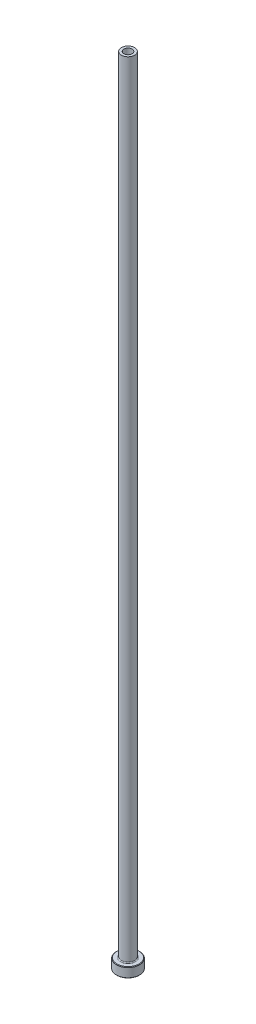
ISO-10303-21;
HEADER;
FILE_DESCRIPTION(('STEP AP214'),'2;1');
FILE_NAME('part.step','',(''),(''),'','','');
FILE_SCHEMA(('AUTOMOTIVE_DESIGN { 1 0 10303 214 1 1 1 1 }'));
ENDSEC;
DATA;
#1=APPLICATION_CONTEXT('core data for automotive mechanical design processes');
#2=APPLICATION_PROTOCOL_DEFINITION('international standard','automotive_design',2000,#1);
#3=PRODUCT_CONTEXT('',#1,'mechanical');
#4=PRODUCT('Part','Part','',(#3));
#5=PRODUCT_RELATED_PRODUCT_CATEGORY('part','',(#4));
#6=PRODUCT_DEFINITION_FORMATION('','',#4);
#7=PRODUCT_DEFINITION_CONTEXT('part definition',#1,'design');
#8=PRODUCT_DEFINITION('design','',#6,#7);
#9=PRODUCT_DEFINITION_SHAPE('','',#8);
#10=(LENGTH_UNIT() NAMED_UNIT(*) SI_UNIT(.MILLI.,.METRE.));
#11=(NAMED_UNIT(*) PLANE_ANGLE_UNIT() SI_UNIT($,.RADIAN.));
#12=(NAMED_UNIT(*) SI_UNIT($,.STERADIAN.) SOLID_ANGLE_UNIT());
#13=UNCERTAINTY_MEASURE_WITH_UNIT(LENGTH_MEASURE(1.E-05),#10,'distance_accuracy_value','');
#14=(GEOMETRIC_REPRESENTATION_CONTEXT(3) GLOBAL_UNCERTAINTY_ASSIGNED_CONTEXT((#13)) GLOBAL_UNIT_ASSIGNED_CONTEXT((#10,
#11,#12)) REPRESENTATION_CONTEXT('',''));
#15=CARTESIAN_POINT('',(0.,0.,0.));
#16=DIRECTION('',(0.,0.,1.));
#17=DIRECTION('',(1.,0.,0.));
#18=AXIS2_PLACEMENT_3D('',#15,#16,#17);
#19=CARTESIAN_POINT('',(0.,0.,0.));
#20=DIRECTION('',(0.,-1.,0.));
#21=DIRECTION('',(0.,0.,-1.));
#22=AXIS2_PLACEMENT_3D('',#19,#20,#21);
#23=PLANE('',#22);
#24=CARTESIAN_POINT('',(0.,0.,0.));
#25=DIRECTION('',(0.,-1.,0.));
#26=DIRECTION('',(0.,0.,-1.));
#27=AXIS2_PLACEMENT_3D('',#24,#25,#26);
#28=CIRCLE('',#27,5.29589999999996);
#29=CARTESIAN_POINT('',(0.,0.,-5.29589999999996));
#30=VERTEX_POINT('',#29);
#31=EDGE_CURVE('E45',#30,#30,#28,.T.);
#32=ORIENTED_EDGE('',*,*,#31,.T.);
#33=EDGE_LOOP('',(#32));
#34=FACE_BOUND('',#33,.T.);
#35=CARTESIAN_POINT('',(0.,0.,0.));
#36=DIRECTION('',(0.,-1.,0.));
#37=DIRECTION('',(0.,0.,-1.));
#38=AXIS2_PLACEMENT_3D('',#35,#36,#37);
#39=CIRCLE('',#38,2.57111500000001);
#40=CARTESIAN_POINT('',(0.,0.,-2.57111500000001));
#41=VERTEX_POINT('',#40);
#42=EDGE_CURVE('E59',#41,#41,#39,.T.);
#43=ORIENTED_EDGE('',*,*,#42,.F.);
#44=EDGE_LOOP('',(#43));
#45=FACE_BOUND('',#44,.T.);
#46=ADVANCED_FACE('F30',(#34,#45),#23,.T.);
#47=CARTESIAN_POINT('',(0.,0.,0.));
#48=DIRECTION('',(0.,-1.,0.));
#49=DIRECTION('',(0.,0.,-1.));
#50=AXIS2_PLACEMENT_3D('',#47,#48,#49);
#51=CYLINDRICAL_SURFACE('',#50,5.5499);
#52=CARTESIAN_POINT('',(0.,0.254000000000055,0.));
#53=DIRECTION('',(0.,-1.,0.));
#54=DIRECTION('',(0.,0.,-1.));
#55=AXIS2_PLACEMENT_3D('',#52,#53,#54);
#56=CIRCLE('',#55,5.5499);
#57=CARTESIAN_POINT('',(0.,0.254000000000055,-5.5499));
#58=VERTEX_POINT('',#57);
#59=EDGE_CURVE('E37',#58,#58,#56,.F.);
#60=ORIENTED_EDGE('',*,*,#59,.T.);
#61=EDGE_LOOP('',(#60));
#62=FACE_BOUND('',#61,.T.);
#63=CARTESIAN_POINT('',(0.,4.49579999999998,0.));
#64=DIRECTION('',(0.,1.,0.));
#65=DIRECTION('',(0.,0.,1.));
#66=AXIS2_PLACEMENT_3D('',#63,#64,#65);
#67=CIRCLE('',#66,5.5499);
#68=CARTESIAN_POINT('',(0.,4.49579999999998,5.5499));
#69=VERTEX_POINT('',#68);
#70=EDGE_CURVE('E41',#69,#69,#67,.F.);
#71=ORIENTED_EDGE('',*,*,#70,.T.);
#72=EDGE_LOOP('',(#71));
#73=FACE_BOUND('',#72,.T.);
#74=ADVANCED_FACE('F104',(#62,#73),#51,.T.);
#75=CARTESIAN_POINT('',(5.5499,4.7498,0.));
#76=DIRECTION('',(0.,1.,0.));
#77=DIRECTION('',(0.,0.,1.));
#78=AXIS2_PLACEMENT_3D('',#75,#76,#77);
#79=PLANE('',#78);
#80=CARTESIAN_POINT('',(0.,4.7498,0.));
#81=DIRECTION('',(0.,1.,0.));
#82=DIRECTION('',(0.,0.,1.));
#83=AXIS2_PLACEMENT_3D('',#80,#81,#82);
#84=CIRCLE('',#83,5.29590000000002);
#85=CARTESIAN_POINT('',(0.,4.7498,5.29590000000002));
#86=VERTEX_POINT('',#85);
#87=EDGE_CURVE('E10',#86,#86,#84,.T.);
#88=ORIENTED_EDGE('',*,*,#87,.T.);
#89=EDGE_LOOP('',(#88));
#90=FACE_BOUND('',#89,.T.);
#91=CARTESIAN_POINT('',(0.,4.7498,0.));
#92=DIRECTION('',(0.,-1.,0.));
#93=DIRECTION('',(0.,0.,-1.));
#94=AXIS2_PLACEMENT_3D('',#91,#92,#93);
#95=CIRCLE('',#94,3.565525);
#96=CARTESIAN_POINT('',(0.,4.7498,-3.565525));
#97=VERTEX_POINT('',#96);
#98=EDGE_CURVE('E50',#97,#97,#95,.T.);
#99=ORIENTED_EDGE('',*,*,#98,.T.);
#100=EDGE_LOOP('',(#99));
#101=FACE_BOUND('',#100,.T.);
#102=ADVANCED_FACE('F110',(#90,#101),#79,.T.);
#103=CARTESIAN_POINT('',(0.,5.146675,0.));
#104=DIRECTION('',(0.,-1.,0.));
#105=DIRECTION('',(0.,0.,-1.));
#106=AXIS2_PLACEMENT_3D('',#103,#104,#105);
#107=TOROIDAL_SURFACE('',#106,3.565525,0.396875);
#108=CARTESIAN_POINT('',(0.,5.146675,0.));
#109=DIRECTION('',(0.,-1.,0.));
#110=DIRECTION('',(0.,0.,-1.));
#111=AXIS2_PLACEMENT_3D('',#108,#109,#110);
#112=CIRCLE('',#111,3.16865);
#113=CARTESIAN_POINT('',(0.,5.146675,-3.16865));
#114=VERTEX_POINT('',#113);
#115=EDGE_CURVE('E53',#114,#114,#112,.T.);
#116=ORIENTED_EDGE('',*,*,#115,.T.);
#117=EDGE_LOOP('',(#116));
#118=FACE_BOUND('',#117,.T.);
#119=ORIENTED_EDGE('',*,*,#98,.F.);
#120=EDGE_LOOP('',(#119));
#121=FACE_BOUND('',#120,.T.);
#122=ADVANCED_FACE('F140',(#118,#121),#107,.F.);
#123=CARTESIAN_POINT('',(0.,0.,0.));
#124=DIRECTION('',(0.,-1.,0.));
#125=DIRECTION('',(0.,0.,-1.));
#126=AXIS2_PLACEMENT_3D('',#123,#124,#125);
#127=CYLINDRICAL_SURFACE('',#126,3.16865);
#128=CARTESIAN_POINT('',(0.,381.,0.));
#129=DIRECTION('',(0.,-1.,0.));
#130=DIRECTION('',(0.,0.,-1.));
#131=AXIS2_PLACEMENT_3D('',#128,#129,#130);
#132=CIRCLE('',#131,3.16865);
#133=CARTESIAN_POINT('',(0.,381.,-3.16865));
#134=VERTEX_POINT('',#133);
#135=EDGE_CURVE('E56',#134,#134,#132,.T.);
#136=ORIENTED_EDGE('',*,*,#135,.T.);
#137=EDGE_LOOP('',(#136));
#138=FACE_BOUND('',#137,.T.);
#139=ORIENTED_EDGE('',*,*,#115,.F.);
#140=EDGE_LOOP('',(#139));
#141=FACE_BOUND('',#140,.T.);
#142=ADVANCED_FACE('F183',(#138,#141),#127,.T.);
#143=CARTESIAN_POINT('',(3.16865,381.,0.));
#144=DIRECTION('',(0.,1.,0.));
#145=DIRECTION('',(0.,0.,1.));
#146=AXIS2_PLACEMENT_3D('',#143,#144,#145);
#147=PLANE('',#146);
#148=CARTESIAN_POINT('',(0.,381.,0.));
#149=DIRECTION('',(0.,-1.,0.));
#150=DIRECTION('',(0.,0.,-1.));
#151=AXIS2_PLACEMENT_3D('',#148,#149,#150);
#152=CIRCLE('',#151,1.98374);
#153=CARTESIAN_POINT('',(0.,381.,-1.98374));
#154=VERTEX_POINT('',#153);
#155=EDGE_CURVE('E71',#154,#154,#152,.T.);
#156=ORIENTED_EDGE('',*,*,#155,.T.);
#157=EDGE_LOOP('',(#156));
#158=FACE_BOUND('',#157,.T.);
#159=ORIENTED_EDGE('',*,*,#135,.F.);
#160=EDGE_LOOP('',(#159));
#161=FACE_BOUND('',#160,.T.);
#162=ADVANCED_FACE('F75',(#158,#161),#147,.T.);
#163=CARTESIAN_POINT('',(0.,0.,0.));
#164=DIRECTION('',(0.,-1.,0.));
#165=DIRECTION('',(0.,0.,-1.));
#166=AXIS2_PLACEMENT_3D('',#163,#164,#165);
#167=CONICAL_SURFACE('',#166,2.57111500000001,0.785398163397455);
#168=CARTESIAN_POINT('',(0.,0.396875,0.));
#169=DIRECTION('',(0.,-1.,0.));
#170=DIRECTION('',(0.,0.,-1.));
#171=AXIS2_PLACEMENT_3D('',#168,#169,#170);
#172=CIRCLE('',#171,2.17424);
#173=CARTESIAN_POINT('',(0.,0.396875,-2.17424));
#174=VERTEX_POINT('',#173);
#175=EDGE_CURVE('E62',#174,#174,#172,.T.);
#176=ORIENTED_EDGE('',*,*,#175,.F.);
#177=EDGE_LOOP('',(#176));
#178=FACE_BOUND('',#177,.T.);
#179=ORIENTED_EDGE('',*,*,#42,.T.);
#180=EDGE_LOOP('',(#179));
#181=FACE_BOUND('',#180,.T.);
#182=ADVANCED_FACE('F94',(#178,#181),#167,.F.);
#183=CARTESIAN_POINT('',(0.,0.,0.));
#184=DIRECTION('',(0.,-1.,0.));
#185=DIRECTION('',(0.,0.,-1.));
#186=AXIS2_PLACEMENT_3D('',#183,#184,#185);
#187=CYLINDRICAL_SURFACE('',#186,2.17424);
#188=CARTESIAN_POINT('',(0.,306.5145,0.));
#189=DIRECTION('',(0.,-1.,0.));
#190=DIRECTION('',(0.,0.,-1.));
#191=AXIS2_PLACEMENT_3D('',#188,#189,#190);
#192=CIRCLE('',#191,2.17424);
#193=CARTESIAN_POINT('',(0.,306.5145,-2.17424));
#194=VERTEX_POINT('',#193);
#195=EDGE_CURVE('E65',#194,#194,#192,.T.);
#196=ORIENTED_EDGE('',*,*,#195,.F.);
#197=EDGE_LOOP('',(#196));
#198=FACE_BOUND('',#197,.T.);
#199=ORIENTED_EDGE('',*,*,#175,.T.);
#200=EDGE_LOOP('',(#199));
#201=FACE_BOUND('',#200,.T.);
#202=ADVANCED_FACE('F88',(#198,#201),#187,.F.);
#203=CARTESIAN_POINT('',(0.,306.5145,0.));
#204=DIRECTION('',(0.,-1.,0.));
#205=DIRECTION('',(0.,0.,-1.));
#206=AXIS2_PLACEMENT_3D('',#203,#204,#205);
#207=CONICAL_SURFACE('',#206,2.17424,0.0133325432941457);
#208=CARTESIAN_POINT('',(0.,320.802,0.));
#209=DIRECTION('',(0.,-1.,0.));
#210=DIRECTION('',(0.,0.,-1.));
#211=AXIS2_PLACEMENT_3D('',#208,#209,#210);
#212=CIRCLE('',#211,1.98374);
#213=CARTESIAN_POINT('',(0.,320.802,-1.98374));
#214=VERTEX_POINT('',#213);
#215=EDGE_CURVE('E68',#214,#214,#212,.T.);
#216=ORIENTED_EDGE('',*,*,#215,.F.);
#217=EDGE_LOOP('',(#216));
#218=FACE_BOUND('',#217,.T.);
#219=ORIENTED_EDGE('',*,*,#195,.T.);
#220=EDGE_LOOP('',(#219));
#221=FACE_BOUND('',#220,.T.);
#222=ADVANCED_FACE('F82',(#218,#221),#207,.F.);
#223=CARTESIAN_POINT('',(0.,0.,0.));
#224=DIRECTION('',(0.,-1.,0.));
#225=DIRECTION('',(0.,0.,-1.));
#226=AXIS2_PLACEMENT_3D('',#223,#224,#225);
#227=CYLINDRICAL_SURFACE('',#226,1.98374);
#228=ORIENTED_EDGE('',*,*,#155,.F.);
#229=EDGE_LOOP('',(#228));
#230=FACE_BOUND('',#229,.T.);
#231=ORIENTED_EDGE('',*,*,#215,.T.);
#232=EDGE_LOOP('',(#231));
#233=FACE_BOUND('',#232,.T.);
#234=ADVANCED_FACE('F78',(#230,#233),#227,.F.);
#235=CARTESIAN_POINT('',(0.,0.,0.));
#236=DIRECTION('',(0.,1.,0.));
#237=DIRECTION('',(0.,0.,1.));
#238=AXIS2_PLACEMENT_3D('',#235,#236,#237);
#239=CONICAL_SURFACE('',#238,5.29589999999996,0.785398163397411);
#240=ORIENTED_EDGE('',*,*,#59,.F.);
#241=EDGE_LOOP('',(#240));
#242=FACE_BOUND('',#241,.T.);
#243=ORIENTED_EDGE('',*,*,#31,.F.);
#244=EDGE_LOOP('',(#243));
#245=FACE_BOUND('',#244,.T.);
#246=ADVANCED_FACE('F81',(#242,#245),#239,.T.);
#247=CARTESIAN_POINT('',(0.,4.49579999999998,0.));
#248=DIRECTION('',(0.,-1.,0.));
#249=DIRECTION('',(0.,0.,-1.));
#250=AXIS2_PLACEMENT_3D('',#247,#248,#249);
#251=CONICAL_SURFACE('',#250,5.5499,0.785398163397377);
#252=ORIENTED_EDGE('',*,*,#87,.F.);
#253=EDGE_LOOP('',(#252));
#254=FACE_BOUND('',#253,.T.);
#255=ORIENTED_EDGE('',*,*,#70,.F.);
#256=EDGE_LOOP('',(#255));
#257=FACE_BOUND('',#256,.T.);
#258=ADVANCED_FACE('F32',(#254,#257),#251,.T.);
#259=CLOSED_SHELL('',(#46,#74,#102,#122,#142,#162,#182,#202,#222,#234,#246,#258));
#260=MANIFOLD_SOLID_BREP('B2',#259);
#261=ADVANCED_BREP_SHAPE_REPRESENTATION('',(#18,#260),#14);
#262=SHAPE_DEFINITION_REPRESENTATION(#9,#261);
ENDSEC;
END-ISO-10303-21;
